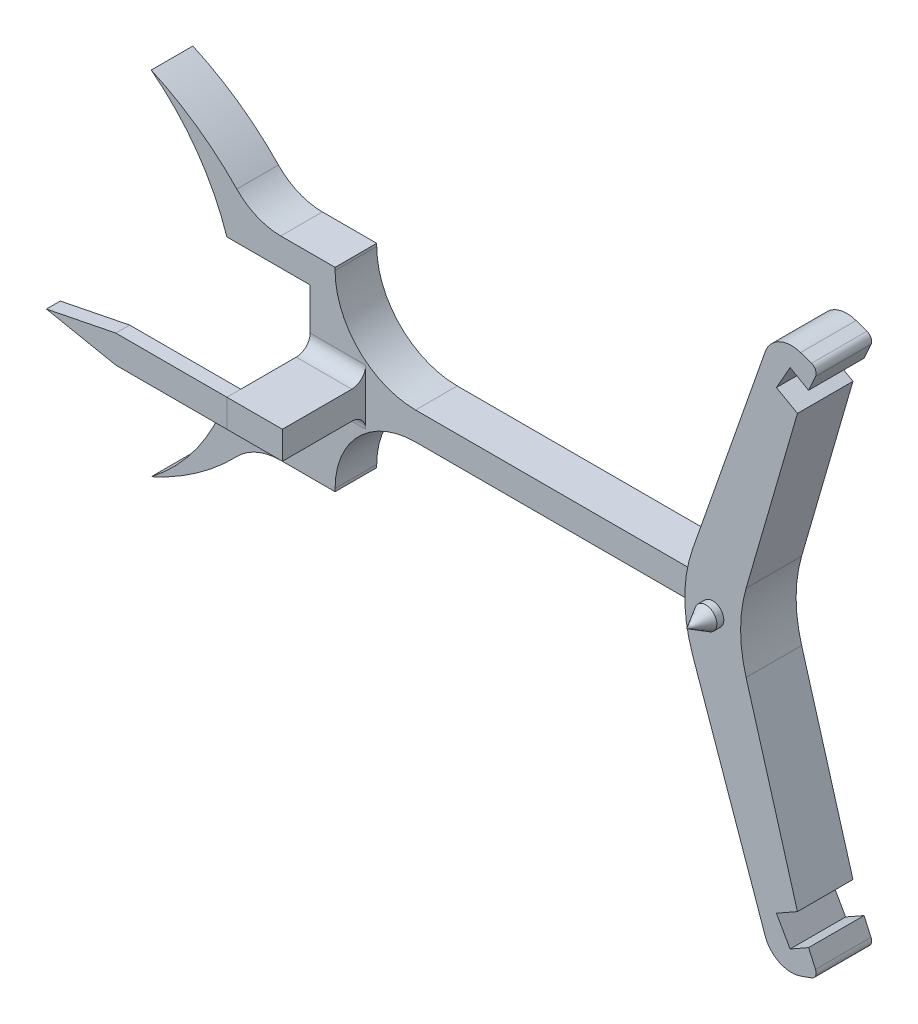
from build123d import *

# Parameters (mm, degrees)
SKETCH2_R           = 0.4
BOSS_EXTRUDE1_DEPTH = 2
BOSS_EXTRUDE4_DEPTH = 1.5
SKETCH7_W           = 2
SKETCH7_H           = 1
BOSS_EXTRUDE5_DEPTH = 3
BOSS_EXTRUDE6_START = 2.5
BOSS_EXTRUDE6_DEPTH = 0.5
FILLET1_R           = 0.5
SKETCH8_R           = 0.4
BOSS_EXTRUDE7_DEPTH = 1.25
SKETCH9_R           = 0.4
BOSS_EXTRUDE8_DEPTH = 2.5
BOSS_EXTRUDE8_TAPER = 30


with BuildPart() as part:
    # Sketch2 → Boss-Extrude1 (new body)
    with BuildSketch(Plane.XY):
        with BuildLine():
            Line((-3.265488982, 1.654139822), (-0.651242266, 9.111312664))
            ThreePointArc((-0.651242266, 9.111312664), (-0.14091085, 9.68170576), (0.623276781, 9.724175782))
            Line((0.623276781, 9.724175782), (1.014889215, 9.586888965))
            ThreePointArc((1.014889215, 9.586888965), (1.161825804, 9.44977827), (1.160358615, 9.248811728))
            Line((1.160358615, 9.248811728), (0.911345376, 8.692605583))
            Line((0.911345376, 8.692605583), (0.246130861, 9.068802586))
            Line((0.246130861, 9.068802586), (-0.246130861, 8.198355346))
            Line((-0.246130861, 8.198355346), (0.510365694, 7.770535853))
            Line((0.510365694, 7.770535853), (-1.339251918, 1.392641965))
            ThreePointArc((-1.339251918, 1.392641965), (-1.537111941, 0), (-1.339251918, -1.392641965))
            Line((-1.339251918, -1.392641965), (0.510365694, -7.770535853))
            Line((0.510365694, -7.770535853), (-0.246130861, -8.198355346))
            Line((-0.246130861, -8.198355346), (0.246130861, -9.068802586))
            Line((0.246130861, -9.068802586), (0.911345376, -8.692605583))
            Line((0.911345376, -8.692605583), (1.160358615, -9.248811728))
            ThreePointArc((1.160358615, -9.248811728), (1.161825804, -9.44977827), (1.014889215, -9.586888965))
            Line((1.014889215, -9.586888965), (0.623276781, -9.724175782))
            ThreePointArc((0.623276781, -9.724175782), (-0.14091085, -9.68170576), (-0.651242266, -9.111312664))
            Line((-0.651242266, -9.111312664), (-3.265488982, -1.654139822))
            ThreePointArc((-3.265488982, -1.654139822), (-3.547033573, 0), (-3.265488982, 1.654139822))
        make_face()
        with Locations((-2.542072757, 0)):
            Circle(SKETCH2_R, mode=Mode.SUBTRACT)
    extrude(amount=BOSS_EXTRUDE1_DEPTH)

    # Sketch4 → Boss-Extrude4 (add)
    with BuildSketch(Plane.XY):
        with BuildLine():
            Line((-3.521970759, 0.5), (-13.743407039, 0.5))
            ThreePointArc((-13.743407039, 0.5), (-15.794016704, 1.349390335), (-16.643407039, 3.4))
            Line((-16.643407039, 3.4), (-16.643407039, 3.5))
            Line((-16.643407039, 3.5), (-17.542072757, 3.5))
            Line((-17.542072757, 3.5), (-18.599687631, 3.5))
            ThreePointArc((-18.599687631, 3.5), (-19.459522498, 3.674985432), (-20.182576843, 4.172105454))
            ThreePointArc((-20.182576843, 4.172105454), (-21.621125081, 5.404160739), (-23.266177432, 6.342874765))
            ThreePointArc((-23.266177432, 6.342874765), (-21.614876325, 4.626477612), (-20.542072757, 2.5))
            Line((-20.542072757, 2.5), (-17.542072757, 2.5))
            Line((-17.542072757, 2.5), (-17.542072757, 2.498997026))
            Line((-17.542072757, 2.498997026), (-17.542072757, -2.5))
            Line((-17.542072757, -2.5), (-20.542072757, -2.5))
            ThreePointArc((-20.542072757, -2.5), (-21.614876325, -4.626477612), (-23.266177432, -6.342874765))
            ThreePointArc((-23.266177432, -6.342874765), (-21.621125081, -5.404160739), (-20.182576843, -4.172105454))
            ThreePointArc((-20.182576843, -4.172105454), (-19.459522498, -3.674985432), (-18.599687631, -3.5))
            Line((-18.599687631, -3.5), (-17.542072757, -3.5))
            Line((-17.542072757, -3.5), (-16.643407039, -3.5))
            Line((-16.643407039, -3.5), (-16.643407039, -3.4))
            ThreePointArc((-16.643407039, -3.4), (-15.794016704, -1.349390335), (-13.743407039, -0.5))
            Line((-13.743407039, -0.5), (-3.521970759, -0.5))
            ThreePointArc((-3.521970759, -0.5), (-3.547033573, 0), (-3.521970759, 0.5))
        make_face()
    extrude(amount=BOSS_EXTRUDE4_DEPTH)

    # Sketch7 → Boss-Extrude5 (add)
    with BuildSketch(Plane.XY.offset(1.5)):
        with Locations((-16.542072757, 0)):
            Rectangle(SKETCH7_W, SKETCH7_H)
    extrude(amount=BOSS_EXTRUDE5_DEPTH)

    # Fillet1
    fillet1_edges = [part.edges().sort_by_distance(p)[0] for p in [
        (-16.542072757, -0.5, 1.5),
        (-16.542072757, 0.5, 1.5),
    ]]
    fillet(fillet1_edges, radius=FILLET1_R)

    # Sketch8 → Boss-Extrude7 (add, symmetric)
    with BuildSketch(Plane.XY.offset(1)):
        with Locations(Location((-2.542072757, 0, 0), (0, 0, 180))):
            Circle(SKETCH8_R)
    extrude(amount=BOSS_EXTRUDE7_DEPTH, both=True)

    # Sketch9 → Boss-Extrude8 (add)
    with BuildSketch(Plane.XY.offset(2.25)):
        with Locations(Location((-2.542072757, 0, 0), (0, 0, 180))):
            Circle(SKETCH9_R)
    boss_extrude8 = extrude(amount=BOSS_EXTRUDE8_DEPTH, taper=BOSS_EXTRUDE8_TAPER)

    # Mirror1: Boss-Extrude8 across plane
    add(boss_extrude8.mirror(Plane.XY.offset(1)))


with BuildPart() as body_2:
    # Sketch6 → Boss-Extrude6 (new body)
    with BuildSketch(Plane.XY.offset(1.5).offset(BOSS_EXTRUDE6_START)):
        Polygon((-21.542072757, 0.5), (-24.042072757, 0), (-21.542072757, -0.5), (-17.542072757, -0.5), (-17.542072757, 0.5), align=None)
    extrude(amount=BOSS_EXTRUDE6_DEPTH)


solid = Compound([part.part, body_2.part])
